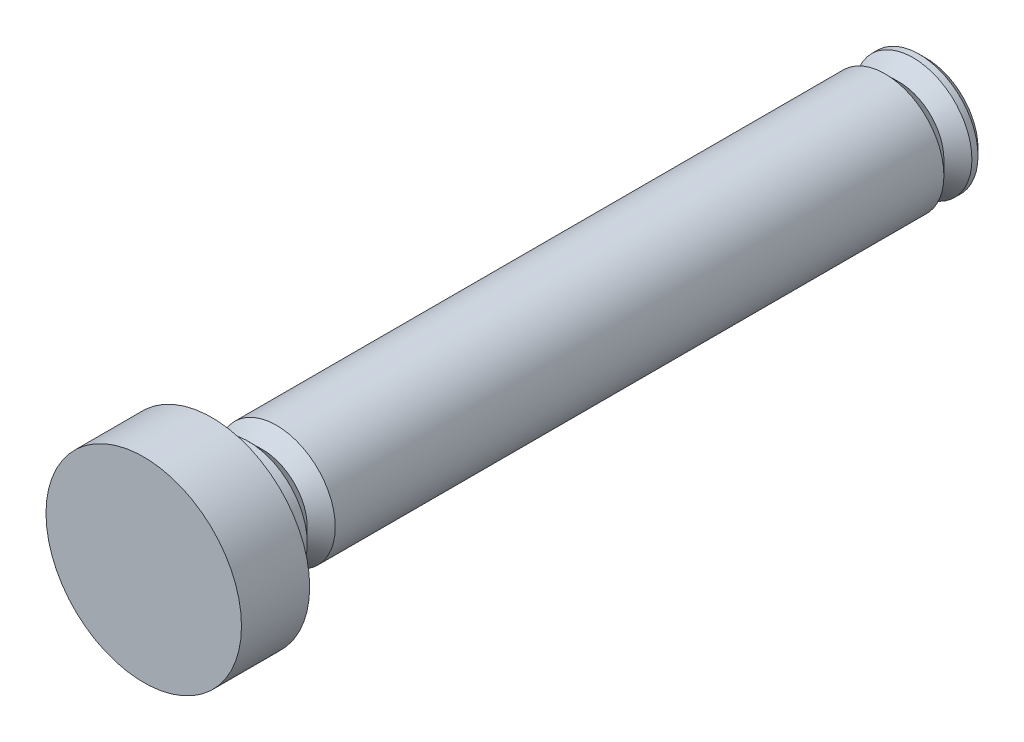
from build123d import *


with BuildPart() as part:
    # Sketch1 → Revolve1 (revolve)
    with BuildSketch(Plane(origin=(0, 0, 0), x_dir=(0, 0, -1), z_dir=(1, 0, 0)), mode=Mode.PRIVATE) as revolve1_sk:
        Polygon((0, 0), (32.639, 0), (32.639, 2.159), (32.3469, 2.4511), (32.0929, 2.4511), (31.5087, 1.8669), (30.9245, 2.4511), (5.5372, 2.4511), (4.953, 1.8669), (4.3688, 2.4511), (2.8448, 2.4511), (2.8448, 4.0767), (0, 4.0767), align=None)
    revolve(revolve1_sk.sketch.rotate(Axis((0, 0, 0), (0, 0, -1)), 90), axis=Axis((0, 0, 0), (0, 0, -1)))


solid = part.part
